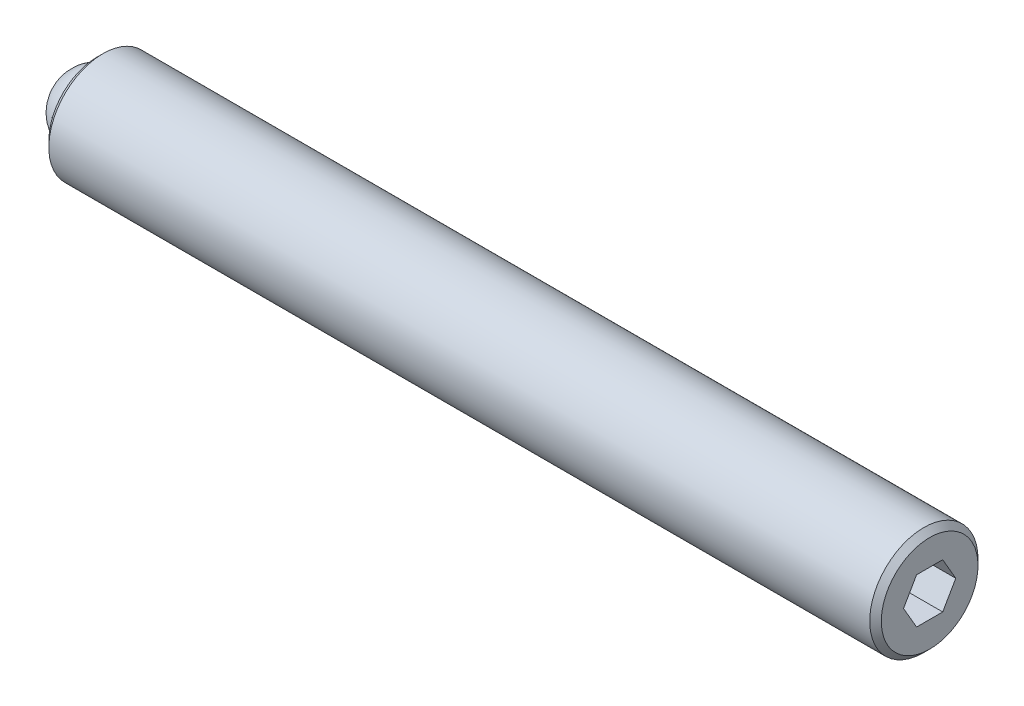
ISO-10303-21;
HEADER;
FILE_DESCRIPTION(('STEP AP214'),'2;1');
FILE_NAME('part.step','',(''),(''),'','','');
FILE_SCHEMA(('AUTOMOTIVE_DESIGN { 1 0 10303 214 1 1 1 1 }'));
ENDSEC;
DATA;
#1=APPLICATION_CONTEXT('core data for automotive mechanical design processes');
#2=APPLICATION_PROTOCOL_DEFINITION('international standard','automotive_design',2000,#1);
#3=PRODUCT_CONTEXT('',#1,'mechanical');
#4=PRODUCT('Part','Part','',(#3));
#5=PRODUCT_RELATED_PRODUCT_CATEGORY('part','',(#4));
#6=PRODUCT_DEFINITION_FORMATION('','',#4);
#7=PRODUCT_DEFINITION_CONTEXT('part definition',#1,'design');
#8=PRODUCT_DEFINITION('design','',#6,#7);
#9=PRODUCT_DEFINITION_SHAPE('','',#8);
#10=(LENGTH_UNIT() NAMED_UNIT(*) SI_UNIT(.MILLI.,.METRE.));
#11=(NAMED_UNIT(*) PLANE_ANGLE_UNIT() SI_UNIT($,.RADIAN.));
#12=(NAMED_UNIT(*) SI_UNIT($,.STERADIAN.) SOLID_ANGLE_UNIT());
#13=UNCERTAINTY_MEASURE_WITH_UNIT(LENGTH_MEASURE(1.E-05),#10,'distance_accuracy_value','');
#14=(GEOMETRIC_REPRESENTATION_CONTEXT(3) GLOBAL_UNCERTAINTY_ASSIGNED_CONTEXT((#13)) GLOBAL_UNIT_ASSIGNED_CONTEXT((#10,
#11,#12)) REPRESENTATION_CONTEXT('',''));
#15=CARTESIAN_POINT('',(0.,0.,0.));
#16=DIRECTION('',(0.,0.,1.));
#17=DIRECTION('',(1.,0.,0.));
#18=AXIS2_PLACEMENT_3D('',#15,#16,#17);
#19=CARTESIAN_POINT('',(0.,0.,0.));
#20=DIRECTION('',(0.,-1.,0.));
#21=DIRECTION('',(0.,0.,1.));
#22=AXIS2_PLACEMENT_3D('',#19,#20,#21);
#23=SPHERICAL_SURFACE('',#22,1.5875);
#24=CARTESIAN_POINT('',(0.,-1.5875,0.));
#25=VERTEX_POINT('',#24);
#26=VERTEX_LOOP('',#25);
#27=FACE_BOUND('',#26,.T.);
#28=ADVANCED_FACE('F43',(#27),#23,.T.);
#29=CLOSED_SHELL('',(#28));
#30=MANIFOLD_SOLID_BREP('B2',#29);
#31=CARTESIAN_POINT('',(36.5125,0.,0.));
#32=DIRECTION('',(-1.,0.,0.));
#33=DIRECTION('',(0.,0.,1.));
#34=AXIS2_PLACEMENT_3D('',#31,#32,#33);
#35=CYLINDRICAL_SURFACE('',#34,2.3749);
#36=CARTESIAN_POINT('',(36.2585,0.,0.));
#37=DIRECTION('',(1.,0.,0.));
#38=DIRECTION('',(0.,0.,-1.));
#39=AXIS2_PLACEMENT_3D('',#36,#37,#38);
#40=CIRCLE('',#39,2.3749);
#41=CARTESIAN_POINT('',(36.2585,0.,-2.3749));
#42=VERTEX_POINT('',#41);
#43=EDGE_CURVE('E41',#42,#42,#40,.F.);
#44=ORIENTED_EDGE('',*,*,#43,.T.);
#45=EDGE_LOOP('',(#44));
#46=FACE_BOUND('',#45,.T.);
#47=CARTESIAN_POINT('',(0.254000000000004,0.,0.));
#48=DIRECTION('',(1.,0.,0.));
#49=DIRECTION('',(0.,0.,-1.));
#50=AXIS2_PLACEMENT_3D('',#47,#48,#49);
#51=CIRCLE('',#50,2.3749);
#52=CARTESIAN_POINT('',(0.254000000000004,0.,-2.3749));
#53=VERTEX_POINT('',#52);
#54=EDGE_CURVE('E177',#53,#53,#51,.T.);
#55=ORIENTED_EDGE('',*,*,#54,.T.);
#56=EDGE_LOOP('',(#55));
#57=FACE_BOUND('',#56,.T.);
#58=ADVANCED_FACE('F56',(#46,#57),#35,.T.);
#59=CARTESIAN_POINT('',(36.5125,0.,0.));
#60=DIRECTION('',(1.,0.,0.));
#61=DIRECTION('',(0.,0.,-1.));
#62=AXIS2_PLACEMENT_3D('',#59,#60,#61);
#63=PLANE('',#62);
#64=DIRECTION('',(0.,0.866025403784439,-0.5));
#65=VECTOR('',#64,1.);
#66=CARTESIAN_POINT('',(36.5125,-0.992187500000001,-0.572839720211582));
#67=LINE('',#66,#65);
#68=CARTESIAN_POINT('',(36.5125,-0.992187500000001,-0.572839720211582));
#69=VERTEX_POINT('',#68);
#70=CARTESIAN_POINT('',(36.5125,0.,-1.14567944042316));
#71=VERTEX_POINT('',#70);
#72=EDGE_CURVE('E78',#69,#71,#67,.T.);
#73=ORIENTED_EDGE('',*,*,#72,.F.);
#74=DIRECTION('',(0.,0.,-1.));
#75=VECTOR('',#74,1.);
#76=CARTESIAN_POINT('',(36.5125,-0.992187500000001,0.572839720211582));
#77=LINE('',#76,#75);
#78=CARTESIAN_POINT('',(36.5125,-0.992187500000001,0.572839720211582));
#79=VERTEX_POINT('',#78);
#80=EDGE_CURVE('E146',#79,#69,#77,.T.);
#81=ORIENTED_EDGE('',*,*,#80,.F.);
#82=DIRECTION('',(0.,-0.866025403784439,-0.5));
#83=VECTOR('',#82,1.);
#84=CARTESIAN_POINT('',(36.5125,0.,1.14567944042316));
#85=LINE('',#84,#83);
#86=CARTESIAN_POINT('',(36.5125,0.,1.14567944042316));
#87=VERTEX_POINT('',#86);
#88=EDGE_CURVE('E170',#87,#79,#85,.T.);
#89=ORIENTED_EDGE('',*,*,#88,.F.);
#90=DIRECTION('',(0.,-0.866025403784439,0.5));
#91=VECTOR('',#90,1.);
#92=CARTESIAN_POINT('',(36.5125,0.992187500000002,0.572839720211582));
#93=LINE('',#92,#91);
#94=CARTESIAN_POINT('',(36.5125,0.992187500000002,0.572839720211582));
#95=VERTEX_POINT('',#94);
#96=EDGE_CURVE('E167',#95,#87,#93,.T.);
#97=ORIENTED_EDGE('',*,*,#96,.F.);
#98=DIRECTION('',(0.,0.,1.));
#99=VECTOR('',#98,1.);
#100=CARTESIAN_POINT('',(36.5125,0.992187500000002,-0.572839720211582));
#101=LINE('',#100,#99);
#102=CARTESIAN_POINT('',(36.5125,0.992187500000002,-0.572839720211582));
#103=VERTEX_POINT('',#102);
#104=EDGE_CURVE('E164',#103,#95,#101,.T.);
#105=ORIENTED_EDGE('',*,*,#104,.F.);
#106=DIRECTION('',(0.,0.866025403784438,0.5));
#107=VECTOR('',#106,1.);
#108=CARTESIAN_POINT('',(36.5125,0.,-1.14567944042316));
#109=LINE('',#108,#107);
#110=EDGE_CURVE('E137',#71,#103,#109,.T.);
#111=ORIENTED_EDGE('',*,*,#110,.F.);
#112=EDGE_LOOP('',(#73,#81,#89,#97,#105,#111));
#113=FACE_BOUND('',#112,.T.);
#114=CARTESIAN_POINT('',(36.5125,0.,0.));
#115=DIRECTION('',(1.,0.,0.));
#116=DIRECTION('',(0.,0.,-1.));
#117=AXIS2_PLACEMENT_3D('',#114,#115,#116);
#118=CIRCLE('',#117,2.1209);
#119=CARTESIAN_POINT('',(36.5125,0.,-2.1209));
#120=VERTEX_POINT('',#119);
#121=EDGE_CURVE('E64',#120,#120,#118,.T.);
#122=ORIENTED_EDGE('',*,*,#121,.T.);
#123=EDGE_LOOP('',(#122));
#124=FACE_BOUND('',#123,.T.);
#125=ADVANCED_FACE('F194',(#113,#124),#63,.T.);
#126=CARTESIAN_POINT('',(0.,0.,0.));
#127=DIRECTION('',(1.,0.,0.));
#128=DIRECTION('',(0.,0.,-1.));
#129=AXIS2_PLACEMENT_3D('',#126,#127,#128);
#130=PLANE('',#129);
#131=CARTESIAN_POINT('',(0.,0.,0.));
#132=DIRECTION('',(-1.,0.,0.));
#133=DIRECTION('',(0.,0.,1.));
#134=AXIS2_PLACEMENT_3D('',#131,#132,#133);
#135=CIRCLE('',#134,1.5875);
#136=CARTESIAN_POINT('',(0.,1.58623,-0.0634872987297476));
#137=VERTEX_POINT('',#136);
#138=CARTESIAN_POINT('',(0.,1.58623,0.0634872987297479));
#139=VERTEX_POINT('',#138);
#140=EDGE_CURVE('E133',#137,#139,#135,.T.);
#141=ORIENTED_EDGE('',*,*,#140,.F.);
#142=CARTESIAN_POINT('',(0.,1.5875,0.));
#143=DIRECTION('',(-1.,0.,0.));
#144=DIRECTION('',(0.,0.,1.));
#145=AXIS2_PLACEMENT_3D('',#142,#143,#144);
#146=CIRCLE('',#145,0.0635000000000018);
#147=EDGE_CURVE('E126',#139,#137,#146,.T.);
#148=ORIENTED_EDGE('',*,*,#147,.F.);
#149=EDGE_LOOP('',(#141,#148));
#150=FACE_BOUND('',#149,.T.);
#151=CARTESIAN_POINT('',(0.,0.,0.));
#152=DIRECTION('',(1.,0.,0.));
#153=DIRECTION('',(0.,0.,-1.));
#154=AXIS2_PLACEMENT_3D('',#151,#152,#153);
#155=CIRCLE('',#154,2.12089999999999);
#156=CARTESIAN_POINT('',(0.,0.,-2.12089999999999));
#157=VERTEX_POINT('',#156);
#158=EDGE_CURVE('E189',#157,#157,#155,.F.);
#159=ORIENTED_EDGE('',*,*,#158,.T.);
#160=EDGE_LOOP('',(#159));
#161=FACE_BOUND('',#160,.T.);
#162=ADVANCED_FACE('F206',(#150,#161),#130,.F.);
#163=CARTESIAN_POINT('',(0.254000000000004,0.,0.));
#164=DIRECTION('',(1.,0.,0.));
#165=DIRECTION('',(0.,0.,-1.));
#166=AXIS2_PLACEMENT_3D('',#163,#164,#165);
#167=CONICAL_SURFACE('',#166,2.3749,0.785398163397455);
#168=ORIENTED_EDGE('',*,*,#158,.F.);
#169=EDGE_LOOP('',(#168));
#170=FACE_BOUND('',#169,.T.);
#171=ORIENTED_EDGE('',*,*,#54,.F.);
#172=EDGE_LOOP('',(#171));
#173=FACE_BOUND('',#172,.T.);
#174=ADVANCED_FACE('F198',(#170,#173),#167,.T.);
#175=CARTESIAN_POINT('',(36.5125,0.,0.));
#176=DIRECTION('',(-1.,0.,0.));
#177=DIRECTION('',(0.,0.,1.));
#178=AXIS2_PLACEMENT_3D('',#175,#176,#177);
#179=CONICAL_SURFACE('',#178,2.1209,0.785398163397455);
#180=ORIENTED_EDGE('',*,*,#43,.F.);
#181=EDGE_LOOP('',(#180));
#182=FACE_BOUND('',#181,.T.);
#183=ORIENTED_EDGE('',*,*,#121,.F.);
#184=EDGE_LOOP('',(#183));
#185=FACE_BOUND('',#184,.T.);
#186=ADVANCED_FACE('F58',(#182,#185),#179,.T.);
#187=CARTESIAN_POINT('',(34.2265,-0.992187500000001,-0.572839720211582));
#188=DIRECTION('',(0.,-0.5,-0.866025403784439));
#189=DIRECTION('',(0.,0.866025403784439,-0.5));
#190=AXIS2_PLACEMENT_3D('',#187,#188,#189);
#191=PLANE('',#190);
#192=ORIENTED_EDGE('',*,*,#72,.T.);
#193=DIRECTION('',(1.,0.,0.));
#194=VECTOR('',#193,1.);
#195=CARTESIAN_POINT('',(34.2265,0.,-1.14567944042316));
#196=LINE('',#195,#194);
#197=CARTESIAN_POINT('',(34.2265,0.,-1.14567944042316));
#198=VERTEX_POINT('',#197);
#199=EDGE_CURVE('E160',#198,#71,#196,.T.);
#200=ORIENTED_EDGE('',*,*,#199,.F.);
#201=DIRECTION('',(0.,0.866025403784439,-0.5));
#202=VECTOR('',#201,1.);
#203=CARTESIAN_POINT('',(34.2265,-0.992187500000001,-0.572839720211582));
#204=LINE('',#203,#202);
#205=CARTESIAN_POINT('',(34.2265,-0.992187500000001,-0.572839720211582));
#206=VERTEX_POINT('',#205);
#207=EDGE_CURVE('E142',#206,#198,#204,.T.);
#208=ORIENTED_EDGE('',*,*,#207,.F.);
#209=DIRECTION('',(1.,0.,0.));
#210=VECTOR('',#209,1.);
#211=CARTESIAN_POINT('',(34.2265,-0.992187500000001,-0.572839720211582));
#212=LINE('',#211,#210);
#213=EDGE_CURVE('E175',#206,#69,#212,.T.);
#214=ORIENTED_EDGE('',*,*,#213,.T.);
#215=EDGE_LOOP('',(#192,#200,#208,#214));
#216=FACE_BOUND('',#215,.T.);
#217=ADVANCED_FACE('F197',(#216),#191,.F.);
#218=CARTESIAN_POINT('',(34.2265,-0.992187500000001,0.572839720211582));
#219=DIRECTION('',(0.,-1.,0.));
#220=DIRECTION('',(0.,0.,-1.));
#221=AXIS2_PLACEMENT_3D('',#218,#219,#220);
#222=PLANE('',#221);
#223=ORIENTED_EDGE('',*,*,#80,.T.);
#224=ORIENTED_EDGE('',*,*,#213,.F.);
#225=DIRECTION('',(0.,0.,-1.));
#226=VECTOR('',#225,1.);
#227=CARTESIAN_POINT('',(34.2265,-0.992187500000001,0.572839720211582));
#228=LINE('',#227,#226);
#229=CARTESIAN_POINT('',(34.2265,-0.992187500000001,0.572839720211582));
#230=VERTEX_POINT('',#229);
#231=EDGE_CURVE('E158',#230,#206,#228,.T.);
#232=ORIENTED_EDGE('',*,*,#231,.F.);
#233=DIRECTION('',(1.,0.,0.));
#234=VECTOR('',#233,1.);
#235=CARTESIAN_POINT('',(34.2265,-0.992187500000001,0.572839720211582));
#236=LINE('',#235,#234);
#237=EDGE_CURVE('E178',#230,#79,#236,.T.);
#238=ORIENTED_EDGE('',*,*,#237,.T.);
#239=EDGE_LOOP('',(#223,#224,#232,#238));
#240=FACE_BOUND('',#239,.T.);
#241=ADVANCED_FACE('F204',(#240),#222,.F.);
#242=CARTESIAN_POINT('',(34.2265,0.,1.14567944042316));
#243=DIRECTION('',(0.,-0.5,0.866025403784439));
#244=DIRECTION('',(0.,-0.866025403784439,-0.5));
#245=AXIS2_PLACEMENT_3D('',#242,#243,#244);
#246=PLANE('',#245);
#247=ORIENTED_EDGE('',*,*,#88,.T.);
#248=ORIENTED_EDGE('',*,*,#237,.F.);
#249=DIRECTION('',(0.,-0.866025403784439,-0.5));
#250=VECTOR('',#249,1.);
#251=CARTESIAN_POINT('',(34.2265,0.,1.14567944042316));
#252=LINE('',#251,#250);
#253=CARTESIAN_POINT('',(34.2265,0.,1.14567944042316));
#254=VERTEX_POINT('',#253);
#255=EDGE_CURVE('E155',#254,#230,#252,.T.);
#256=ORIENTED_EDGE('',*,*,#255,.F.);
#257=DIRECTION('',(1.,0.,0.));
#258=VECTOR('',#257,1.);
#259=CARTESIAN_POINT('',(34.2265,0.,1.14567944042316));
#260=LINE('',#259,#258);
#261=EDGE_CURVE('E180',#254,#87,#260,.T.);
#262=ORIENTED_EDGE('',*,*,#261,.T.);
#263=EDGE_LOOP('',(#247,#248,#256,#262));
#264=FACE_BOUND('',#263,.T.);
#265=ADVANCED_FACE('F234',(#264),#246,.F.);
#266=CARTESIAN_POINT('',(34.2265,0.992187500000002,0.572839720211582));
#267=DIRECTION('',(0.,0.5,0.866025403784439));
#268=DIRECTION('',(0.,-0.866025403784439,0.5));
#269=AXIS2_PLACEMENT_3D('',#266,#267,#268);
#270=PLANE('',#269);
#271=ORIENTED_EDGE('',*,*,#96,.T.);
#272=ORIENTED_EDGE('',*,*,#261,.F.);
#273=DIRECTION('',(0.,-0.866025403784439,0.5));
#274=VECTOR('',#273,1.);
#275=CARTESIAN_POINT('',(34.2265,0.992187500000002,0.572839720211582));
#276=LINE('',#275,#274);
#277=CARTESIAN_POINT('',(34.2265,0.992187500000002,0.572839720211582));
#278=VERTEX_POINT('',#277);
#279=EDGE_CURVE('E152',#278,#254,#276,.T.);
#280=ORIENTED_EDGE('',*,*,#279,.F.);
#281=DIRECTION('',(1.,0.,0.));
#282=VECTOR('',#281,1.);
#283=CARTESIAN_POINT('',(34.2265,0.992187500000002,0.572839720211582));
#284=LINE('',#283,#282);
#285=EDGE_CURVE('E182',#278,#95,#284,.T.);
#286=ORIENTED_EDGE('',*,*,#285,.T.);
#287=EDGE_LOOP('',(#271,#272,#280,#286));
#288=FACE_BOUND('',#287,.T.);
#289=ADVANCED_FACE('F230',(#288),#270,.F.);
#290=CARTESIAN_POINT('',(34.2265,0.992187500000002,-0.572839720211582));
#291=DIRECTION('',(0.,1.,0.));
#292=DIRECTION('',(0.,0.,1.));
#293=AXIS2_PLACEMENT_3D('',#290,#291,#292);
#294=PLANE('',#293);
#295=ORIENTED_EDGE('',*,*,#104,.T.);
#296=ORIENTED_EDGE('',*,*,#285,.F.);
#297=DIRECTION('',(0.,0.,1.));
#298=VECTOR('',#297,1.);
#299=CARTESIAN_POINT('',(34.2265,0.992187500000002,-0.572839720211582));
#300=LINE('',#299,#298);
#301=CARTESIAN_POINT('',(34.2265,0.992187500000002,-0.572839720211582));
#302=VERTEX_POINT('',#301);
#303=EDGE_CURVE('E149',#302,#278,#300,.T.);
#304=ORIENTED_EDGE('',*,*,#303,.F.);
#305=DIRECTION('',(1.,0.,0.));
#306=VECTOR('',#305,1.);
#307=CARTESIAN_POINT('',(34.2265,0.992187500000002,-0.572839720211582));
#308=LINE('',#307,#306);
#309=EDGE_CURVE('E184',#302,#103,#308,.T.);
#310=ORIENTED_EDGE('',*,*,#309,.T.);
#311=EDGE_LOOP('',(#295,#296,#304,#310));
#312=FACE_BOUND('',#311,.T.);
#313=ADVANCED_FACE('F226',(#312),#294,.F.);
#314=CARTESIAN_POINT('',(34.2265,0.,-1.14567944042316));
#315=DIRECTION('',(0.,0.5,-0.866025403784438));
#316=DIRECTION('',(0.,0.866025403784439,0.5));
#317=AXIS2_PLACEMENT_3D('',#314,#315,#316);
#318=PLANE('',#317);
#319=ORIENTED_EDGE('',*,*,#110,.T.);
#320=ORIENTED_EDGE('',*,*,#309,.F.);
#321=DIRECTION('',(0.,0.866025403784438,0.5));
#322=VECTOR('',#321,1.);
#323=CARTESIAN_POINT('',(34.2265,0.,-1.14567944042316));
#324=LINE('',#323,#322);
#325=EDGE_CURVE('E145',#198,#302,#324,.T.);
#326=ORIENTED_EDGE('',*,*,#325,.F.);
#327=ORIENTED_EDGE('',*,*,#199,.T.);
#328=EDGE_LOOP('',(#319,#320,#326,#327));
#329=FACE_BOUND('',#328,.T.);
#330=ADVANCED_FACE('F222',(#329),#318,.F.);
#331=CARTESIAN_POINT('',(34.2265,0.,0.));
#332=DIRECTION('',(1.,0.,0.));
#333=DIRECTION('',(0.,0.,-1.));
#334=AXIS2_PLACEMENT_3D('',#331,#332,#333);
#335=PLANE('',#334);
#336=ORIENTED_EDGE('',*,*,#207,.T.);
#337=ORIENTED_EDGE('',*,*,#325,.T.);
#338=ORIENTED_EDGE('',*,*,#303,.T.);
#339=ORIENTED_EDGE('',*,*,#279,.T.);
#340=ORIENTED_EDGE('',*,*,#255,.T.);
#341=ORIENTED_EDGE('',*,*,#231,.T.);
#342=EDGE_LOOP('',(#336,#337,#338,#339,#340,#341));
#343=FACE_BOUND('',#342,.T.);
#344=ADVANCED_FACE('F225',(#343),#335,.T.);
#345=CARTESIAN_POINT('',(1.5875,0.,0.));
#346=DIRECTION('',(-1.,0.,0.));
#347=DIRECTION('',(0.,0.,1.));
#348=AXIS2_PLACEMENT_3D('',#345,#346,#347);
#349=CYLINDRICAL_SURFACE('',#348,1.5875);
#350=CARTESIAN_POINT('',(1.5875,0.,0.));
#351=DIRECTION('',(-1.,0.,0.));
#352=DIRECTION('',(0.,0.,1.));
#353=AXIS2_PLACEMENT_3D('',#350,#351,#352);
#354=CIRCLE('',#353,1.5875);
#355=CARTESIAN_POINT('',(1.5875,1.58623,-0.0634872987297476));
#356=VERTEX_POINT('',#355);
#357=CARTESIAN_POINT('',(1.5875,1.58623,0.0634872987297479));
#358=VERTEX_POINT('',#357);
#359=EDGE_CURVE('E131',#356,#358,#354,.T.);
#360=ORIENTED_EDGE('',*,*,#359,.F.);
#361=DIRECTION('',(-1.,0.,0.));
#362=VECTOR('',#361,1.);
#363=CARTESIAN_POINT('',(1.5875,1.58623,-0.0634872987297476));
#364=LINE('',#363,#362);
#365=EDGE_CURVE('E124',#356,#137,#364,.T.);
#366=ORIENTED_EDGE('',*,*,#365,.T.);
#367=ORIENTED_EDGE('',*,*,#140,.T.);
#368=DIRECTION('',(-1.,0.,0.));
#369=VECTOR('',#368,1.);
#370=CARTESIAN_POINT('',(1.5875,1.58623,0.0634872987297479));
#371=LINE('',#370,#369);
#372=EDGE_CURVE('E121',#358,#139,#371,.T.);
#373=ORIENTED_EDGE('',*,*,#372,.F.);
#374=EDGE_LOOP('',(#360,#366,#367,#373));
#375=FACE_BOUND('',#374,.T.);
#376=ADVANCED_FACE('F130',(#375),#349,.F.);
#377=CARTESIAN_POINT('',(1.5875,0.,0.));
#378=DIRECTION('',(-1.,0.,0.));
#379=DIRECTION('',(0.,0.,1.));
#380=AXIS2_PLACEMENT_3D('',#377,#378,#379);
#381=PLANE('',#380);
#382=ORIENTED_EDGE('',*,*,#359,.T.);
#383=CARTESIAN_POINT('',(1.5875,1.5875,0.));
#384=DIRECTION('',(-1.,0.,0.));
#385=DIRECTION('',(0.,0.,1.));
#386=AXIS2_PLACEMENT_3D('',#383,#384,#385);
#387=CIRCLE('',#386,0.0635000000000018);
#388=EDGE_CURVE('E70',#358,#356,#387,.T.);
#389=ORIENTED_EDGE('',*,*,#388,.T.);
#390=EDGE_LOOP('',(#382,#389));
#391=FACE_BOUND('',#390,.T.);
#392=ADVANCED_FACE('F135',(#391),#381,.T.);
#393=CARTESIAN_POINT('',(1.5875,1.5875,0.));
#394=DIRECTION('',(-1.,0.,0.));
#395=DIRECTION('',(0.,0.,1.));
#396=AXIS2_PLACEMENT_3D('',#393,#394,#395);
#397=CYLINDRICAL_SURFACE('',#396,0.0635000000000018);
#398=ORIENTED_EDGE('',*,*,#147,.T.);
#399=ORIENTED_EDGE('',*,*,#365,.F.);
#400=ORIENTED_EDGE('',*,*,#388,.F.);
#401=ORIENTED_EDGE('',*,*,#372,.T.);
#402=EDGE_LOOP('',(#398,#399,#400,#401));
#403=FACE_BOUND('',#402,.T.);
#404=ADVANCED_FACE('F120',(#403),#397,.F.);
#405=CLOSED_SHELL('',(#58,#125,#162,#174,#186,#217,#241,#265,#289,#313,#330,#344,#376,#392,#404));
#406=MANIFOLD_SOLID_BREP('B6',#405);
#407=ADVANCED_BREP_SHAPE_REPRESENTATION('',(#18,#30,#406),#14);
#408=SHAPE_DEFINITION_REPRESENTATION(#9,#407);
ENDSEC;
END-ISO-10303-21;
